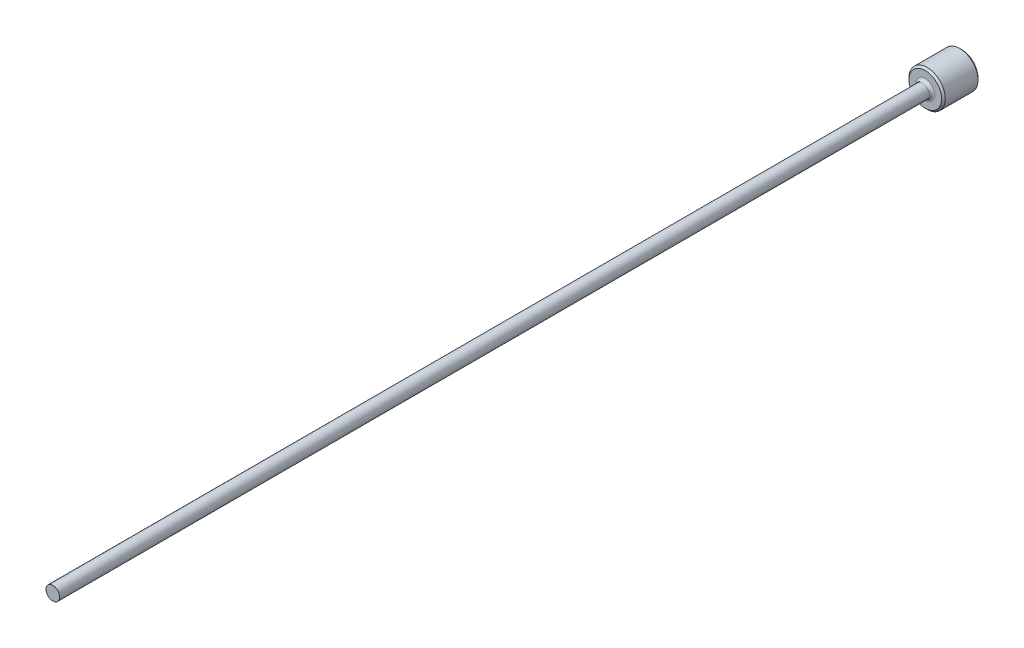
ISO-10303-21;
HEADER;
FILE_DESCRIPTION(('STEP AP214'),'2;1');
FILE_NAME('part.step','',(''),(''),'','','');
FILE_SCHEMA(('AUTOMOTIVE_DESIGN { 1 0 10303 214 1 1 1 1 }'));
ENDSEC;
DATA;
#1=APPLICATION_CONTEXT('core data for automotive mechanical design processes');
#2=APPLICATION_PROTOCOL_DEFINITION('international standard','automotive_design',2000,#1);
#3=PRODUCT_CONTEXT('',#1,'mechanical');
#4=PRODUCT('Part','Part','',(#3));
#5=PRODUCT_RELATED_PRODUCT_CATEGORY('part','',(#4));
#6=PRODUCT_DEFINITION_FORMATION('','',#4);
#7=PRODUCT_DEFINITION_CONTEXT('part definition',#1,'design');
#8=PRODUCT_DEFINITION('design','',#6,#7);
#9=PRODUCT_DEFINITION_SHAPE('','',#8);
#10=(LENGTH_UNIT() NAMED_UNIT(*) SI_UNIT(.MILLI.,.METRE.));
#11=(NAMED_UNIT(*) PLANE_ANGLE_UNIT() SI_UNIT($,.RADIAN.));
#12=(NAMED_UNIT(*) SI_UNIT($,.STERADIAN.) SOLID_ANGLE_UNIT());
#13=UNCERTAINTY_MEASURE_WITH_UNIT(LENGTH_MEASURE(1.E-05),#10,'distance_accuracy_value','');
#14=(GEOMETRIC_REPRESENTATION_CONTEXT(3) GLOBAL_UNCERTAINTY_ASSIGNED_CONTEXT((#13)) GLOBAL_UNIT_ASSIGNED_CONTEXT((#10,
#11,#12)) REPRESENTATION_CONTEXT('',''));
#15=CARTESIAN_POINT('',(0.,0.,0.));
#16=DIRECTION('',(0.,0.,1.));
#17=DIRECTION('',(1.,0.,0.));
#18=AXIS2_PLACEMENT_3D('',#15,#16,#17);
#19=CARTESIAN_POINT('',(0.,0.749999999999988,100.));
#20=DIRECTION('',(0.,0.,-1.));
#21=DIRECTION('',(-1.,0.,0.));
#22=AXIS2_PLACEMENT_3D('',#19,#20,#21);
#23=PLANE('',#22);
#24=CARTESIAN_POINT('',(0.,0.,100.));
#25=DIRECTION('',(0.,0.,1.));
#26=DIRECTION('',(1.,0.,0.));
#27=AXIS2_PLACEMENT_3D('',#24,#25,#26);
#28=CIRCLE('',#27,0.749999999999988);
#29=CARTESIAN_POINT('',(0.749999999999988,0.,100.));
#30=VERTEX_POINT('',#29);
#31=EDGE_CURVE('E50',#30,#30,#28,.T.);
#32=ORIENTED_EDGE('',*,*,#31,.T.);
#33=EDGE_LOOP('',(#32));
#34=FACE_BOUND('',#33,.T.);
#35=ADVANCED_FACE('F30',(#34),#23,.F.);
#36=CARTESIAN_POINT('',(0.,0.,109.050628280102));
#37=DIRECTION('',(0.,0.,1.));
#38=DIRECTION('',(1.,0.,0.));
#39=AXIS2_PLACEMENT_3D('',#36,#37,#38);
#40=CYLINDRICAL_SURFACE('',#39,0.749999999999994);
#41=ORIENTED_EDGE('',*,*,#31,.F.);
#42=EDGE_LOOP('',(#41));
#43=FACE_BOUND('',#42,.T.);
#44=CARTESIAN_POINT('',(0.,0.,4.3));
#45=DIRECTION('',(0.,0.,1.));
#46=DIRECTION('',(1.,0.,0.));
#47=AXIS2_PLACEMENT_3D('',#44,#45,#46);
#48=CIRCLE('',#47,0.75);
#49=CARTESIAN_POINT('',(0.75,0.,4.3));
#50=VERTEX_POINT('',#49);
#51=EDGE_CURVE('E53',#50,#50,#48,.T.);
#52=ORIENTED_EDGE('',*,*,#51,.T.);
#53=EDGE_LOOP('',(#52));
#54=FACE_BOUND('',#53,.T.);
#55=ADVANCED_FACE('F73',(#43,#54),#40,.T.);
#56=CARTESIAN_POINT('',(0.,0.,4.3));
#57=DIRECTION('',(0.,0.,1.));
#58=DIRECTION('',(1.,0.,0.));
#59=AXIS2_PLACEMENT_3D('',#56,#57,#58);
#60=TOROIDAL_SURFACE('',#59,1.05,0.3);
#61=ORIENTED_EDGE('',*,*,#51,.F.);
#62=EDGE_LOOP('',(#61));
#63=FACE_BOUND('',#62,.T.);
#64=CARTESIAN_POINT('',(0.,0.,4.));
#65=DIRECTION('',(0.,0.,1.));
#66=DIRECTION('',(1.,0.,0.));
#67=AXIS2_PLACEMENT_3D('',#64,#65,#66);
#68=CIRCLE('',#67,1.05);
#69=CARTESIAN_POINT('',(1.05,0.,4.));
#70=VERTEX_POINT('',#69);
#71=EDGE_CURVE('E56',#70,#70,#68,.T.);
#72=ORIENTED_EDGE('',*,*,#71,.T.);
#73=EDGE_LOOP('',(#72));
#74=FACE_BOUND('',#73,.T.);
#75=ADVANCED_FACE('F60',(#63,#74),#60,.F.);
#76=CARTESIAN_POINT('',(0.,2.,4.));
#77=DIRECTION('',(0.,0.,-1.));
#78=DIRECTION('',(-1.,0.,0.));
#79=AXIS2_PLACEMENT_3D('',#76,#77,#78);
#80=PLANE('',#79);
#81=CARTESIAN_POINT('',(0.,0.,4.));
#82=DIRECTION('',(0.,0.,-1.));
#83=DIRECTION('',(-1.,0.,0.));
#84=AXIS2_PLACEMENT_3D('',#81,#82,#83);
#85=CIRCLE('',#84,1.8);
#86=CARTESIAN_POINT('',(-1.8,0.,4.));
#87=VERTEX_POINT('',#86);
#88=EDGE_CURVE('E10',#87,#87,#85,.F.);
#89=ORIENTED_EDGE('',*,*,#88,.T.);
#90=EDGE_LOOP('',(#89));
#91=FACE_BOUND('',#90,.T.);
#92=ORIENTED_EDGE('',*,*,#71,.F.);
#93=EDGE_LOOP('',(#92));
#94=FACE_BOUND('',#93,.T.);
#95=ADVANCED_FACE('F62',(#91,#94),#80,.F.);
#96=CARTESIAN_POINT('',(0.,0.,109.050628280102));
#97=DIRECTION('',(0.,0.,1.));
#98=DIRECTION('',(1.,0.,0.));
#99=AXIS2_PLACEMENT_3D('',#96,#97,#98);
#100=CYLINDRICAL_SURFACE('',#99,2.);
#101=CARTESIAN_POINT('',(0.,0.,0.199999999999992));
#102=DIRECTION('',(0.,0.,1.));
#103=DIRECTION('',(1.,0.,0.));
#104=AXIS2_PLACEMENT_3D('',#101,#102,#103);
#105=CIRCLE('',#104,2.);
#106=CARTESIAN_POINT('',(2.,0.,0.199999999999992));
#107=VERTEX_POINT('',#106);
#108=EDGE_CURVE('E41',#107,#107,#105,.T.);
#109=ORIENTED_EDGE('',*,*,#108,.T.);
#110=EDGE_LOOP('',(#109));
#111=FACE_BOUND('',#110,.T.);
#112=CARTESIAN_POINT('',(0.,0.,3.8));
#113=DIRECTION('',(0.,0.,-1.));
#114=DIRECTION('',(-1.,0.,0.));
#115=AXIS2_PLACEMENT_3D('',#112,#113,#114);
#116=CIRCLE('',#115,2.);
#117=CARTESIAN_POINT('',(-2.,0.,3.8));
#118=VERTEX_POINT('',#117);
#119=EDGE_CURVE('E45',#118,#118,#116,.T.);
#120=ORIENTED_EDGE('',*,*,#119,.T.);
#121=EDGE_LOOP('',(#120));
#122=FACE_BOUND('',#121,.T.);
#123=ADVANCED_FACE('F64',(#111,#122),#100,.T.);
#124=CARTESIAN_POINT('',(0.,0.,0.));
#125=DIRECTION('',(0.,0.,1.));
#126=DIRECTION('',(1.,0.,0.));
#127=AXIS2_PLACEMENT_3D('',#124,#125,#126);
#128=PLANE('',#127);
#129=CARTESIAN_POINT('',(0.,0.,0.));
#130=DIRECTION('',(0.,0.,1.));
#131=DIRECTION('',(1.,0.,0.));
#132=AXIS2_PLACEMENT_3D('',#129,#130,#131);
#133=CIRCLE('',#132,1.8);
#134=CARTESIAN_POINT('',(1.8,0.,0.));
#135=VERTEX_POINT('',#134);
#136=EDGE_CURVE('E37',#135,#135,#133,.F.);
#137=ORIENTED_EDGE('',*,*,#136,.T.);
#138=EDGE_LOOP('',(#137));
#139=FACE_BOUND('',#138,.T.);
#140=ADVANCED_FACE('F70',(#139),#128,.F.);
#141=CARTESIAN_POINT('',(0.,0.,0.199999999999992));
#142=DIRECTION('',(0.,0.,1.));
#143=DIRECTION('',(1.,0.,0.));
#144=AXIS2_PLACEMENT_3D('',#141,#142,#143);
#145=CONICAL_SURFACE('',#144,2.,0.785398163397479);
#146=ORIENTED_EDGE('',*,*,#136,.F.);
#147=EDGE_LOOP('',(#146));
#148=FACE_BOUND('',#147,.T.);
#149=ORIENTED_EDGE('',*,*,#108,.F.);
#150=EDGE_LOOP('',(#149));
#151=FACE_BOUND('',#150,.T.);
#152=ADVANCED_FACE('F84',(#148,#151),#145,.T.);
#153=CARTESIAN_POINT('',(0.,0.,4.));
#154=DIRECTION('',(0.,0.,-1.));
#155=DIRECTION('',(-1.,0.,0.));
#156=AXIS2_PLACEMENT_3D('',#153,#154,#155);
#157=CONICAL_SURFACE('',#156,1.8,0.785398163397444);
#158=ORIENTED_EDGE('',*,*,#119,.F.);
#159=EDGE_LOOP('',(#158));
#160=FACE_BOUND('',#159,.T.);
#161=ORIENTED_EDGE('',*,*,#88,.F.);
#162=EDGE_LOOP('',(#161));
#163=FACE_BOUND('',#162,.T.);
#164=ADVANCED_FACE('F32',(#160,#163),#157,.T.);
#165=CLOSED_SHELL('',(#35,#55,#75,#95,#123,#140,#152,#164));
#166=MANIFOLD_SOLID_BREP('B2',#165);
#167=ADVANCED_BREP_SHAPE_REPRESENTATION('',(#18,#166),#14);
#168=SHAPE_DEFINITION_REPRESENTATION(#9,#167);
ENDSEC;
END-ISO-10303-21;
